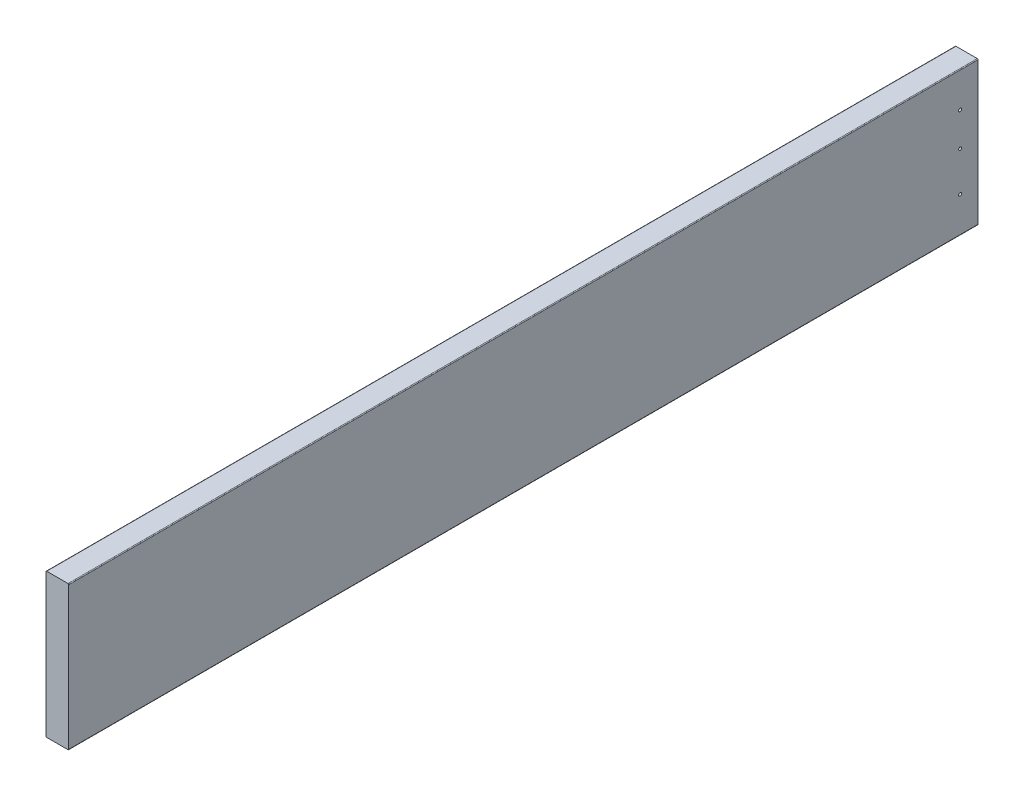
from build123d import *

# Parameters (mm, degrees)
SKETCH1_W          = 38.1
SKETCH1_H          = 241.3
EXTRUDE1_DEPTH     = 1524
FILLET1_R          = 1.27
SKETCH2_R          = 2.5
CUT_EXTRUDE1_DEPTH = 17.78
CUT_EXTRUDE2_START = -17.78
SKETCH3_R          = 2.5
CUT_EXTRUDE2_DEPTH = 17.78


with BuildPart() as part:
    # Sketch1 → Extrude1 (new body)
    with BuildSketch(Plane.XY):
        Rectangle(SKETCH1_W, SKETCH1_H)
    extrude(amount=EXTRUDE1_DEPTH)

    # Fillet1
    fillet1_edges = [part.edges().sort_by_distance(p)[0] for p in [
        (-19.05, 120.65, 762),
        (19.05, 120.65, 762),
        (19.05, -120.65, 762),
        (-19.05, -120.65, 762),
    ]]
    fillet(fillet1_edges, radius=FILLET1_R)

    # Sketch2 → Cut-Extrude1 (cut)
    with BuildSketch(Plane(origin=(19.05, 0, 0), x_dir=(0, 0, -1), z_dir=(1, 0, 0))):
        with Locations(Location((-30, -60.854239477, 0), (0, 0, 90))):
            Circle(SKETCH2_R)
        with Locations(Location((-30, 5.395760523, 0), (0, 0, 90))):
            Circle(SKETCH2_R)
        with Locations(Location((-30, 61.645760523, 0), (0, 0, 90))):
            Circle(SKETCH2_R)
    extrude(amount=-CUT_EXTRUDE1_DEPTH, mode=Mode.SUBTRACT)

    # Sketch3 → Cut-Extrude2 (cut)
    with BuildSketch(Plane.ZY.offset(19.05).offset(CUT_EXTRUDE2_START)):
        with Locations(Location((30, -60.854239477, 0), (0, 0, 90))):
            Circle(SKETCH3_R)
        with Locations(Location((30, 5.395760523, 0), (0, 0, 90))):
            Circle(SKETCH3_R)
        with Locations(Location((30, 61.645760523, 0), (0, 0, 90))):
            Circle(SKETCH3_R)
    extrude(amount=CUT_EXTRUDE2_DEPTH, mode=Mode.SUBTRACT)


solid = part.part
